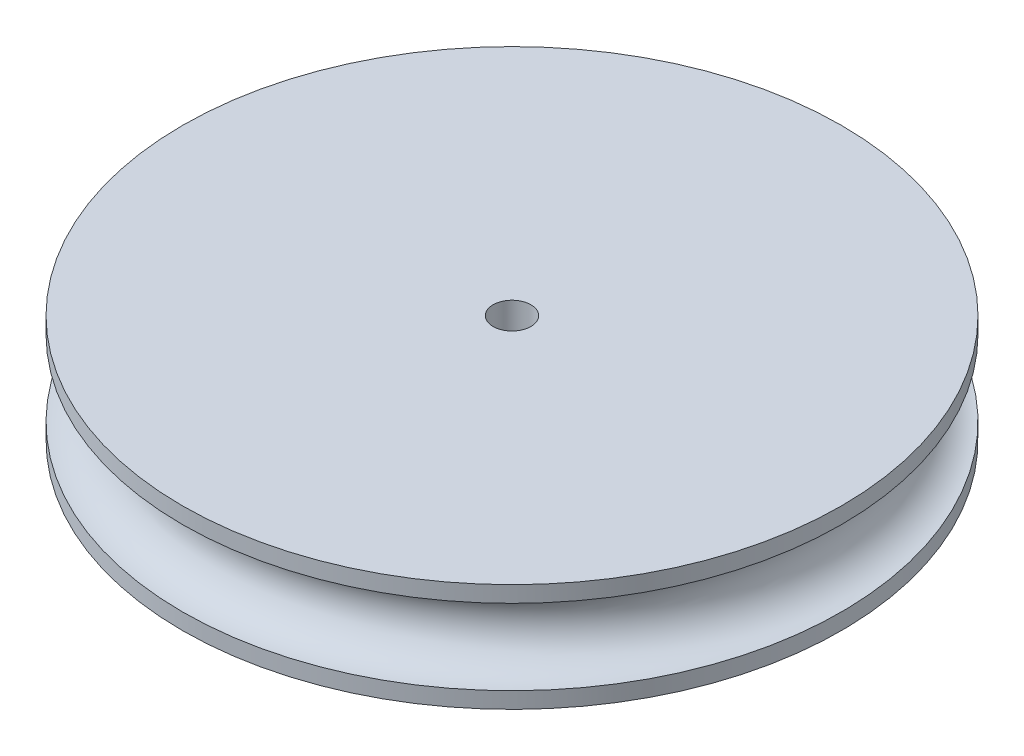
from build123d import *

# Parameters (mm, degrees)
SKETCH1_RX          = 9.779
SKETCH1_RY          = 7.366
BOSS_EXTRUDE1_DEPTH = 24.892
FILLET1_R           = 2.54
SKETCH2_R           = 2.921
BOSS_EXTRUDE2_DEPTH = 1.27
SKETCH3_R           = 2.794
CUT_EXTRUDE1_DEPTH  = 0.0635
SKETCH4_R           = 0.127
BOSS_EXTRUDE3_DEPTH = 6.35
BOSS_EXTRUDE4_DEPTH = 1.905
CHAMFER1_SIZE       = 0.635
SKETCH6_R           = 15.494
SKETCH6_R_2         = 0.254
BOSS_EXTRUDE5_DEPTH = 5.08
SKETCH7_R           = 1.778
SKETCH8_R           = 15.494
CUT_EXTRUDE2_DEPTH  = 37.616767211
SKETCH9_R           = 0.889
CUT_EXTRUDE3_DEPTH  = 23.492987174


with BuildPart() as part:
    # Sketch1 → Boss-Extrude1 (new body)
    with BuildSketch(Plane(origin=(0, 0, 0), x_dir=(1, 0, 0), z_dir=(0, 1, 0))):
        with Locations(Location((0, 0), (0, 0, 180))):
            Ellipse(SKETCH1_RX, SKETCH1_RY)
    extrude(amount=BOSS_EXTRUDE1_DEPTH)

    # Fillet1
    fillet1_edges = [part.edges().sort_by_distance(p)[0] for p in [
        (9.778999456, 0, -0.002456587),
        (9.778999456, 24.892, -0.002456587),
    ]]
    fillet(fillet1_edges, radius=FILLET1_R)

    # Sketch2 → Boss-Extrude2 (add)
    with BuildSketch(Plane(origin=(0, 24.892, 0), x_dir=(1, 0, 0), z_dir=(0, 1, 0))):
        with Locations(Location((0, 0, 0), (0, 0, 270))):
            Circle(SKETCH2_R)
    extrude(amount=BOSS_EXTRUDE2_DEPTH)

    # Sketch3 → Cut-Extrude1 (cut)
    with BuildSketch(Plane(origin=(0, 26.162, 0), x_dir=(1, 0, 0), z_dir=(0, 1, 0))):
        with Locations(Location((0, 0, 0), (0, 0, 270))):
            Circle(SKETCH3_R)
    extrude(amount=-CUT_EXTRUDE1_DEPTH, mode=Mode.SUBTRACT)

    # Sketch4 → Boss-Extrude3 (add)
    with BuildSketch(Plane(origin=(0, 26.0985, 0), x_dir=(1, 0, 0), z_dir=(0, 1, 0))):
        with Locations(Location((0, 0, 0), (0, 0, 270))):
            Circle(SKETCH4_R)
    extrude(amount=BOSS_EXTRUDE3_DEPTH)

    # Sketch5 → Boss-Extrude4 (add)
    with BuildSketch(Plane.XZ):
        with BuildLine():
            Line((2.602725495, 4.064), (-2.602725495, 4.064))
            ThreePointArc((-2.602725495, 4.064), (-2.316195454, -4.233853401), (4.826, 0))
            ThreePointArc((4.826, 0), (4.233853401, 2.316195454), (2.602725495, 4.064))
        make_face()
    extrude(amount=BOSS_EXTRUDE4_DEPTH)

    # Chamfer1
    chamfer1_edges = [part.edges().sort_by_distance(p)[0] for p in [
        (0, -1.905, -4.826),
    ]]
    chamfer(chamfer1_edges, length=CHAMFER1_SIZE)

    # Sketch8 → Cut-Extrude2 (cut, through all)
    with BuildSketch(Plane.XZ.offset(-27.432)):
        with Locations(Location((0, 0, 0), (0, 0, 270))):
            Circle(SKETCH8_R)
    extrude(amount=CUT_EXTRUDE2_DEPTH, mode=Mode.SUBTRACT)


with BuildPart() as body_2:
    # Sketch6 → Boss-Extrude5 (new body)
    with BuildSketch(Plane(origin=(0, 27.432, 0), x_dir=(1, 0, 0), z_dir=(0, 1, 0))):
        with Locations(Location((0, 0, 0), (0, 0, 270))):
            Circle(SKETCH6_R)
        with Locations(Location((0, 0, 0), (0, 0, 270))):
            Circle(SKETCH6_R_2, mode=Mode.SUBTRACT)
    extrude(amount=BOSS_EXTRUDE5_DEPTH)

    # Sketch7 → Cut-Revolve1 (revolve, cut)
    with BuildSketch(Plane.XY, mode=Mode.PRIVATE) as cut_revolve1_sk:
        with Locations((15.494, 29.972)):
            Circle(SKETCH7_R)
    revolve(cut_revolve1_sk.sketch.rotate(Axis((0, 32.4485, 0), (0, -1, 0)), 90), axis=Axis((0, 32.4485, 0), (0, -1, 0)), mode=Mode.SUBTRACT)


with BuildPart() as cut_extrude3_tool:
    # Sketch9 → Cut-Extrude3 (new, through all)
    with BuildSketch(Plane.XZ.offset(-27.432)):
        with Locations(Location((0, 0, 0), (0, 0, 270))):
            Circle(SKETCH9_R)
    extrude(amount=-CUT_EXTRUDE3_DEPTH)


with BuildPart() as part_1:
    add(part.part)

    # Cut-Extrude3: cut by cut_extrude3_tool
    add(cut_extrude3_tool.part, mode=Mode.SUBTRACT)


with BuildPart() as body_2_1:
    add(body_2.part)

    # Cut-Extrude3: cut by cut_extrude3_tool
    add(cut_extrude3_tool.part, mode=Mode.SUBTRACT)


solid = body_2_1.part
